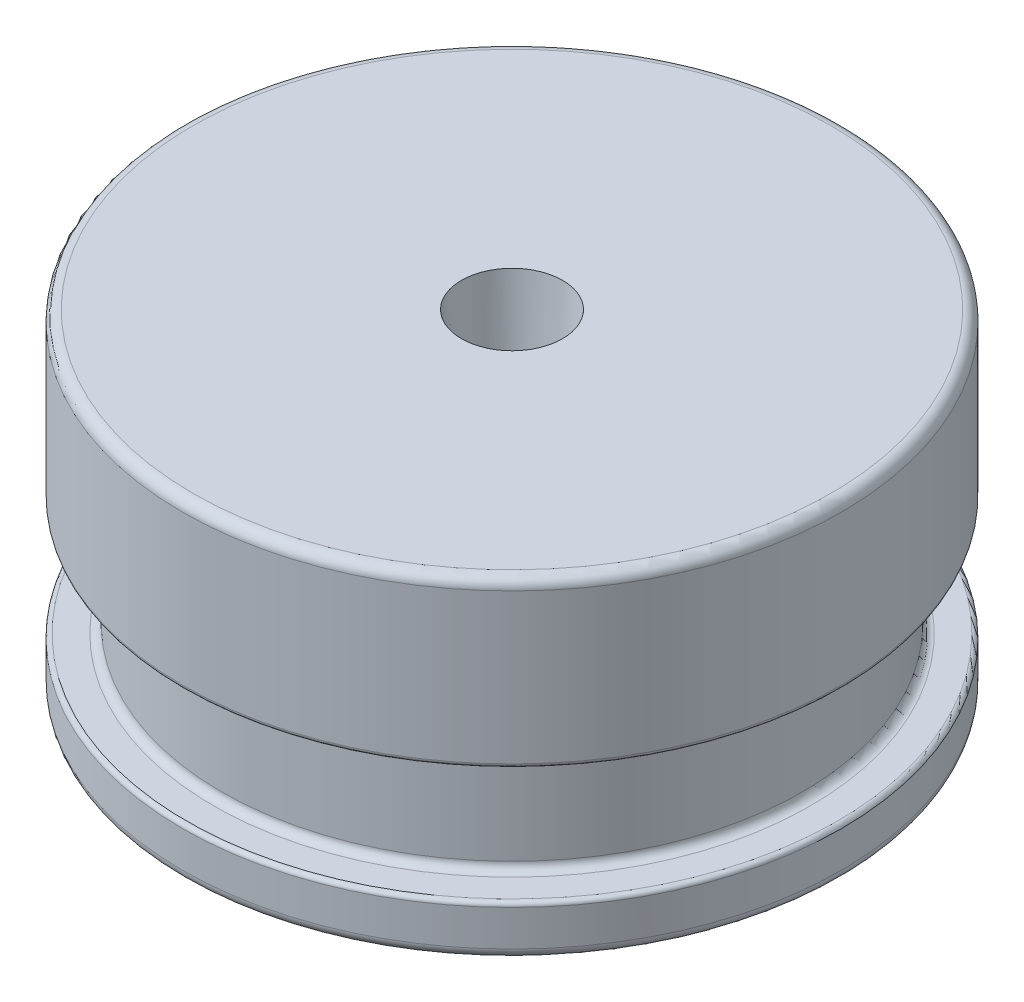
ISO-10303-21;
HEADER;
FILE_DESCRIPTION(('STEP AP214'),'2;1');
FILE_NAME('part.step','',(''),(''),'','','');
FILE_SCHEMA(('AUTOMOTIVE_DESIGN { 1 0 10303 214 1 1 1 1 }'));
ENDSEC;
DATA;
#1=APPLICATION_CONTEXT('core data for automotive mechanical design processes');
#2=APPLICATION_PROTOCOL_DEFINITION('international standard','automotive_design',2000,#1);
#3=PRODUCT_CONTEXT('',#1,'mechanical');
#4=PRODUCT('Part','Part','',(#3));
#5=PRODUCT_RELATED_PRODUCT_CATEGORY('part','',(#4));
#6=PRODUCT_DEFINITION_FORMATION('','',#4);
#7=PRODUCT_DEFINITION_CONTEXT('part definition',#1,'design');
#8=PRODUCT_DEFINITION('design','',#6,#7);
#9=PRODUCT_DEFINITION_SHAPE('','',#8);
#10=(LENGTH_UNIT() NAMED_UNIT(*) SI_UNIT(.MILLI.,.METRE.));
#11=(NAMED_UNIT(*) PLANE_ANGLE_UNIT() SI_UNIT($,.RADIAN.));
#12=(NAMED_UNIT(*) SI_UNIT($,.STERADIAN.) SOLID_ANGLE_UNIT());
#13=UNCERTAINTY_MEASURE_WITH_UNIT(LENGTH_MEASURE(1.E-05),#10,'distance_accuracy_value','');
#14=(GEOMETRIC_REPRESENTATION_CONTEXT(3) GLOBAL_UNCERTAINTY_ASSIGNED_CONTEXT((#13)) GLOBAL_UNIT_ASSIGNED_CONTEXT((#10,
#11,#12)) REPRESENTATION_CONTEXT('',''));
#15=CARTESIAN_POINT('',(0.,0.,0.));
#16=DIRECTION('',(0.,0.,1.));
#17=DIRECTION('',(1.,0.,0.));
#18=AXIS2_PLACEMENT_3D('',#15,#16,#17);
#19=CARTESIAN_POINT('',(1.7272,0.,0.));
#20=DIRECTION('',(0.,1.,0.));
#21=DIRECTION('',(0.,0.,1.));
#22=AXIS2_PLACEMENT_3D('',#19,#20,#21);
#23=PLANE('',#22);
#24=CARTESIAN_POINT('',(0.,0.,0.));
#25=DIRECTION('',(0.,1.,0.));
#26=DIRECTION('',(0.,0.,1.));
#27=AXIS2_PLACEMENT_3D('',#24,#25,#26);
#28=CIRCLE('',#27,12.9806674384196);
#29=CARTESIAN_POINT('',(0.,0.,12.9806674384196));
#30=VERTEX_POINT('',#29);
#31=EDGE_CURVE('E56',#30,#30,#28,.T.);
#32=ORIENTED_EDGE('',*,*,#31,.T.);
#33=EDGE_LOOP('',(#32));
#34=FACE_BOUND('',#33,.T.);
#35=CARTESIAN_POINT('',(0.,0.,0.));
#36=DIRECTION('',(0.,1.,0.));
#37=DIRECTION('',(0.,0.,1.));
#38=AXIS2_PLACEMENT_3D('',#35,#36,#37);
#39=CIRCLE('',#38,15.0495);
#40=CARTESIAN_POINT('',(0.,0.,15.0495));
#41=VERTEX_POINT('',#40);
#42=EDGE_CURVE('E69',#41,#41,#39,.F.);
#43=ORIENTED_EDGE('',*,*,#42,.T.);
#44=EDGE_LOOP('',(#43));
#45=FACE_BOUND('',#44,.T.);
#46=ADVANCED_FACE('F35',(#34,#45),#23,.F.);
#47=CARTESIAN_POINT('',(0.,19.7432386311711,0.));
#48=DIRECTION('',(0.,1.,0.));
#49=DIRECTION('',(0.,0.,1.));
#50=AXIS2_PLACEMENT_3D('',#47,#48,#49);
#51=CYLINDRICAL_SURFACE('',#50,1.7272);
#52=CARTESIAN_POINT('',(0.,8.10867846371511,0.));
#53=DIRECTION('',(0.,-1.,0.));
#54=DIRECTION('',(0.,0.,-1.));
#55=AXIS2_PLACEMENT_3D('',#52,#53,#54);
#56=CIRCLE('',#55,1.7272);
#57=CARTESIAN_POINT('',(0.,8.10867846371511,-1.7272));
#58=VERTEX_POINT('',#57);
#59=EDGE_CURVE('E63',#58,#58,#56,.T.);
#60=ORIENTED_EDGE('',*,*,#59,.F.);
#61=EDGE_LOOP('',(#60));
#62=FACE_BOUND('',#61,.T.);
#63=CARTESIAN_POINT('',(0.,0.,0.));
#64=DIRECTION('',(0.,1.,0.));
#65=DIRECTION('',(0.,0.,1.));
#66=AXIS2_PLACEMENT_3D('',#63,#64,#65);
#67=CIRCLE('',#66,1.7272);
#68=CARTESIAN_POINT('',(0.,0.,1.7272));
#69=VERTEX_POINT('',#68);
#70=EDGE_CURVE('E59',#69,#69,#67,.T.);
#71=ORIENTED_EDGE('',*,*,#70,.F.);
#72=EDGE_LOOP('',(#71));
#73=FACE_BOUND('',#72,.T.);
#74=ADVANCED_FACE('F105',(#62,#73),#51,.F.);
#75=CARTESIAN_POINT('',(0.,0.,0.));
#76=DIRECTION('',(0.,-1.,0.));
#77=DIRECTION('',(0.,0.,-1.));
#78=AXIS2_PLACEMENT_3D('',#75,#76,#77);
#79=CIRCLE('',#78,7.84733256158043);
#80=CARTESIAN_POINT('',(0.,0.,-7.84733256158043));
#81=VERTEX_POINT('',#80);
#82=EDGE_CURVE('E60',#81,#81,#79,.T.);
#83=ORIENTED_EDGE('',*,*,#82,.T.);
#84=EDGE_LOOP('',(#83));
#85=FACE_BOUND('',#84,.T.);
#86=ORIENTED_EDGE('',*,*,#70,.T.);
#87=EDGE_LOOP('',(#86));
#88=FACE_BOUND('',#87,.T.);
#89=ADVANCED_FACE('F37',(#85,#88),#23,.F.);
#90=CARTESIAN_POINT('',(0.,19.7432386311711,0.));
#91=DIRECTION('',(0.,1.,0.));
#92=DIRECTION('',(0.,0.,1.));
#93=AXIS2_PLACEMENT_3D('',#90,#91,#92);
#94=CYLINDRICAL_SURFACE('',#93,15.5575);
#95=CARTESIAN_POINT('',(0.,2.2098,0.));
#96=DIRECTION('',(0.,-1.,0.));
#97=DIRECTION('',(0.,0.,-1.));
#98=AXIS2_PLACEMENT_3D('',#95,#96,#97);
#99=CIRCLE('',#98,15.5575);
#100=CARTESIAN_POINT('',(0.,2.2098,-15.5575));
#101=VERTEX_POINT('',#100);
#102=EDGE_CURVE('E12',#101,#101,#99,.T.);
#103=ORIENTED_EDGE('',*,*,#102,.T.);
#104=EDGE_LOOP('',(#103));
#105=FACE_BOUND('',#104,.T.);
#106=CARTESIAN_POINT('',(0.,0.508000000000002,0.));
#107=DIRECTION('',(0.,1.,0.));
#108=DIRECTION('',(0.,0.,1.));
#109=AXIS2_PLACEMENT_3D('',#106,#107,#108);
#110=CIRCLE('',#109,15.5575);
#111=CARTESIAN_POINT('',(0.,0.508000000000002,15.5575));
#112=VERTEX_POINT('',#111);
#113=EDGE_CURVE('E72',#112,#112,#110,.T.);
#114=ORIENTED_EDGE('',*,*,#113,.T.);
#115=EDGE_LOOP('',(#114));
#116=FACE_BOUND('',#115,.T.);
#117=ADVANCED_FACE('F112',(#105,#116),#94,.T.);
#118=CARTESIAN_POINT('',(13.716,2.413,0.));
#119=DIRECTION('',(0.,-1.,0.));
#120=DIRECTION('',(0.,0.,-1.));
#121=AXIS2_PLACEMENT_3D('',#118,#119,#120);
#122=PLANE('',#121);
#123=CARTESIAN_POINT('',(0.,2.413,0.));
#124=DIRECTION('',(0.,-1.,0.));
#125=DIRECTION('',(0.,0.,-1.));
#126=AXIS2_PLACEMENT_3D('',#123,#124,#125);
#127=CIRCLE('',#126,15.3543);
#128=CARTESIAN_POINT('',(0.,2.413,-15.3543));
#129=VERTEX_POINT('',#128);
#130=EDGE_CURVE('E42',#129,#129,#127,.F.);
#131=ORIENTED_EDGE('',*,*,#130,.T.);
#132=EDGE_LOOP('',(#131));
#133=FACE_BOUND('',#132,.T.);
#134=CARTESIAN_POINT('',(0.,2.413,0.));
#135=DIRECTION('',(0.,-1.,0.));
#136=DIRECTION('',(0.,0.,-1.));
#137=AXIS2_PLACEMENT_3D('',#134,#135,#136);
#138=CIRCLE('',#137,14.097);
#139=CARTESIAN_POINT('',(0.,2.413,-14.097));
#140=VERTEX_POINT('',#139);
#141=EDGE_CURVE('E78',#140,#140,#138,.T.);
#142=ORIENTED_EDGE('',*,*,#141,.T.);
#143=EDGE_LOOP('',(#142));
#144=FACE_BOUND('',#143,.T.);
#145=ADVANCED_FACE('F117',(#133,#144),#122,.F.);
#146=CARTESIAN_POINT('',(0.,19.7432386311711,0.));
#147=DIRECTION('',(0.,1.,0.));
#148=DIRECTION('',(0.,0.,1.));
#149=AXIS2_PLACEMENT_3D('',#146,#147,#148);
#150=CYLINDRICAL_SURFACE('',#149,13.716);
#151=CARTESIAN_POINT('',(0.,2.794,0.));
#152=DIRECTION('',(0.,-1.,0.));
#153=DIRECTION('',(0.,0.,-1.));
#154=AXIS2_PLACEMENT_3D('',#151,#152,#153);
#155=CIRCLE('',#154,13.716);
#156=CARTESIAN_POINT('',(0.,2.794,-13.716));
#157=VERTEX_POINT('',#156);
#158=EDGE_CURVE('E81',#157,#157,#155,.F.);
#159=ORIENTED_EDGE('',*,*,#158,.T.);
#160=EDGE_LOOP('',(#159));
#161=FACE_BOUND('',#160,.T.);
#162=CARTESIAN_POINT('',(0.,7.493,0.));
#163=DIRECTION('',(0.,1.,0.));
#164=DIRECTION('',(0.,0.,1.));
#165=AXIS2_PLACEMENT_3D('',#162,#163,#164);
#166=CIRCLE('',#165,13.716);
#167=CARTESIAN_POINT('',(0.,7.493,13.716));
#168=VERTEX_POINT('',#167);
#169=EDGE_CURVE('E84',#168,#168,#166,.F.);
#170=ORIENTED_EDGE('',*,*,#169,.T.);
#171=EDGE_LOOP('',(#170));
#172=FACE_BOUND('',#171,.T.);
#173=ADVANCED_FACE('F158',(#161,#172),#150,.T.);
#174=CARTESIAN_POINT('',(13.716,7.874,0.));
#175=DIRECTION('',(0.,1.,0.));
#176=DIRECTION('',(0.,0.,1.));
#177=AXIS2_PLACEMENT_3D('',#174,#175,#176);
#178=PLANE('',#177);
#179=CARTESIAN_POINT('',(0.,7.874,0.));
#180=DIRECTION('',(0.,1.,0.));
#181=DIRECTION('',(0.,0.,1.));
#182=AXIS2_PLACEMENT_3D('',#179,#180,#181);
#183=CIRCLE('',#182,15.3543);
#184=CARTESIAN_POINT('',(0.,7.874,15.3543));
#185=VERTEX_POINT('',#184);
#186=EDGE_CURVE('E46',#185,#185,#183,.F.);
#187=ORIENTED_EDGE('',*,*,#186,.T.);
#188=EDGE_LOOP('',(#187));
#189=FACE_BOUND('',#188,.T.);
#190=CARTESIAN_POINT('',(0.,7.874,0.));
#191=DIRECTION('',(0.,1.,0.));
#192=DIRECTION('',(0.,0.,1.));
#193=AXIS2_PLACEMENT_3D('',#190,#191,#192);
#194=CIRCLE('',#193,14.097);
#195=CARTESIAN_POINT('',(0.,7.874,14.097));
#196=VERTEX_POINT('',#195);
#197=EDGE_CURVE('E75',#196,#196,#194,.T.);
#198=ORIENTED_EDGE('',*,*,#197,.T.);
#199=EDGE_LOOP('',(#198));
#200=FACE_BOUND('',#199,.T.);
#201=ADVANCED_FACE('F154',(#189,#200),#178,.F.);
#202=CARTESIAN_POINT('',(0.,19.7432386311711,0.));
#203=DIRECTION('',(0.,1.,0.));
#204=DIRECTION('',(0.,0.,1.));
#205=AXIS2_PLACEMENT_3D('',#202,#203,#204);
#206=CYLINDRICAL_SURFACE('',#205,15.5575);
#207=CARTESIAN_POINT('',(0.,8.0772,0.));
#208=DIRECTION('',(0.,1.,0.));
#209=DIRECTION('',(0.,0.,1.));
#210=AXIS2_PLACEMENT_3D('',#207,#208,#209);
#211=CIRCLE('',#210,15.5575);
#212=CARTESIAN_POINT('',(0.,8.0772,15.5575));
#213=VERTEX_POINT('',#212);
#214=EDGE_CURVE('E50',#213,#213,#211,.T.);
#215=ORIENTED_EDGE('',*,*,#214,.T.);
#216=EDGE_LOOP('',(#215));
#217=FACE_BOUND('',#216,.T.);
#218=CARTESIAN_POINT('',(0.,15.1490850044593,0.));
#219=DIRECTION('',(0.,1.,0.));
#220=DIRECTION('',(0.,0.,1.));
#221=AXIS2_PLACEMENT_3D('',#218,#219,#220);
#222=CIRCLE('',#221,15.5575);
#223=CARTESIAN_POINT('',(0.,15.1490850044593,15.5575));
#224=VERTEX_POINT('',#223);
#225=EDGE_CURVE('E55',#224,#224,#222,.F.);
#226=ORIENTED_EDGE('',*,*,#225,.T.);
#227=EDGE_LOOP('',(#226));
#228=FACE_BOUND('',#227,.T.);
#229=ADVANCED_FACE('F149',(#217,#228),#206,.T.);
#230=CARTESIAN_POINT('',(0.,2.794,0.));
#231=DIRECTION('',(0.,-1.,0.));
#232=DIRECTION('',(0.,0.,-1.));
#233=AXIS2_PLACEMENT_3D('',#230,#231,#232);
#234=TOROIDAL_SURFACE('',#233,14.097,0.381);
#235=ORIENTED_EDGE('',*,*,#141,.F.);
#236=EDGE_LOOP('',(#235));
#237=FACE_BOUND('',#236,.T.);
#238=ORIENTED_EDGE('',*,*,#158,.F.);
#239=EDGE_LOOP('',(#238));
#240=FACE_BOUND('',#239,.T.);
#241=ADVANCED_FACE('F146',(#237,#240),#234,.F.);
#242=CARTESIAN_POINT('',(0.,7.493,0.));
#243=DIRECTION('',(0.,1.,0.));
#244=DIRECTION('',(0.,0.,1.));
#245=AXIS2_PLACEMENT_3D('',#242,#243,#244);
#246=TOROIDAL_SURFACE('',#245,14.097,0.381);
#247=ORIENTED_EDGE('',*,*,#169,.F.);
#248=EDGE_LOOP('',(#247));
#249=FACE_BOUND('',#248,.T.);
#250=ORIENTED_EDGE('',*,*,#197,.F.);
#251=EDGE_LOOP('',(#250));
#252=FACE_BOUND('',#251,.T.);
#253=ADVANCED_FACE('F140',(#249,#252),#246,.F.);
#254=CARTESIAN_POINT('',(0.,15.6570850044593,0.));
#255=DIRECTION('',(0.,1.,0.));
#256=DIRECTION('',(0.,0.,1.));
#257=AXIS2_PLACEMENT_3D('',#254,#255,#256);
#258=PLANE('',#257);
#259=CARTESIAN_POINT('',(0.,15.6570850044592,0.));
#260=DIRECTION('',(0.,-1.,0.));
#261=DIRECTION('',(0.,0.,-1.));
#262=AXIS2_PLACEMENT_3D('',#259,#260,#261);
#263=CIRCLE('',#262,2.3876);
#264=CARTESIAN_POINT('',(0.,15.6570850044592,-2.3876));
#265=VERTEX_POINT('',#264);
#266=EDGE_CURVE('E91',#265,#265,#263,.T.);
#267=ORIENTED_EDGE('',*,*,#266,.T.);
#268=EDGE_LOOP('',(#267));
#269=FACE_BOUND('',#268,.T.);
#270=CARTESIAN_POINT('',(0.,15.6570850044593,0.));
#271=DIRECTION('',(0.,1.,0.));
#272=DIRECTION('',(0.,0.,1.));
#273=AXIS2_PLACEMENT_3D('',#270,#271,#272);
#274=CIRCLE('',#273,15.0495);
#275=CARTESIAN_POINT('',(0.,15.6570850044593,15.0495));
#276=VERTEX_POINT('',#275);
#277=EDGE_CURVE('E66',#276,#276,#274,.T.);
#278=ORIENTED_EDGE('',*,*,#277,.T.);
#279=EDGE_LOOP('',(#278));
#280=FACE_BOUND('',#279,.T.);
#281=ADVANCED_FACE('F95',(#269,#280),#258,.T.);
#282=CARTESIAN_POINT('',(0.,0.508000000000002,0.));
#283=DIRECTION('',(0.,1.,0.));
#284=DIRECTION('',(0.,0.,1.));
#285=AXIS2_PLACEMENT_3D('',#282,#283,#284);
#286=TOROIDAL_SURFACE('',#285,15.0495,0.508);
#287=ORIENTED_EDGE('',*,*,#42,.F.);
#288=EDGE_LOOP('',(#287));
#289=FACE_BOUND('',#288,.T.);
#290=ORIENTED_EDGE('',*,*,#113,.F.);
#291=EDGE_LOOP('',(#290));
#292=FACE_BOUND('',#291,.T.);
#293=ADVANCED_FACE('F126',(#289,#292),#286,.T.);
#294=CARTESIAN_POINT('',(0.,15.1490850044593,0.));
#295=DIRECTION('',(0.,1.,0.));
#296=DIRECTION('',(0.,0.,1.));
#297=AXIS2_PLACEMENT_3D('',#294,#295,#296);
#298=TOROIDAL_SURFACE('',#297,15.0495,0.508);
#299=ORIENTED_EDGE('',*,*,#225,.F.);
#300=EDGE_LOOP('',(#299));
#301=FACE_BOUND('',#300,.T.);
#302=ORIENTED_EDGE('',*,*,#277,.F.);
#303=EDGE_LOOP('',(#302));
#304=FACE_BOUND('',#303,.T.);
#305=ADVANCED_FACE('F129',(#301,#304),#298,.T.);
#306=CARTESIAN_POINT('',(0.,-1.86891499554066,0.));
#307=DIRECTION('',(0.,-1.,0.));
#308=DIRECTION('',(0.,0.,-1.));
#309=AXIS2_PLACEMENT_3D('',#306,#307,#308);
#310=TOROIDAL_SURFACE('',#309,10.414,3.175);
#311=ORIENTED_EDGE('',*,*,#82,.F.);
#312=EDGE_LOOP('',(#311));
#313=FACE_BOUND('',#312,.T.);
#314=ORIENTED_EDGE('',*,*,#31,.F.);
#315=EDGE_LOOP('',(#314));
#316=FACE_BOUND('',#315,.T.);
#317=ADVANCED_FACE('F137',(#313,#316),#310,.F.);
#318=CARTESIAN_POINT('',(0.,8.0772,0.));
#319=DIRECTION('',(0.,1.,0.));
#320=DIRECTION('',(0.,0.,1.));
#321=AXIS2_PLACEMENT_3D('',#318,#319,#320);
#322=TOROIDAL_SURFACE('',#321,15.3543,0.2032);
#323=ORIENTED_EDGE('',*,*,#186,.F.);
#324=EDGE_LOOP('',(#323));
#325=FACE_BOUND('',#324,.T.);
#326=ORIENTED_EDGE('',*,*,#214,.F.);
#327=EDGE_LOOP('',(#326));
#328=FACE_BOUND('',#327,.T.);
#329=ADVANCED_FACE('F221',(#325,#328),#322,.T.);
#330=CARTESIAN_POINT('',(0.,2.2098,0.));
#331=DIRECTION('',(0.,-1.,0.));
#332=DIRECTION('',(0.,0.,-1.));
#333=AXIS2_PLACEMENT_3D('',#330,#331,#332);
#334=TOROIDAL_SURFACE('',#333,15.3543,0.2032);
#335=ORIENTED_EDGE('',*,*,#102,.F.);
#336=EDGE_LOOP('',(#335));
#337=FACE_BOUND('',#336,.T.);
#338=ORIENTED_EDGE('',*,*,#130,.F.);
#339=EDGE_LOOP('',(#338));
#340=FACE_BOUND('',#339,.T.);
#341=ADVANCED_FACE('F101',(#337,#340),#334,.T.);
#342=CARTESIAN_POINT('',(0.,8.10867846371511,0.));
#343=DIRECTION('',(0.,1.,0.));
#344=DIRECTION('',(0.,0.,1.));
#345=AXIS2_PLACEMENT_3D('',#342,#343,#344);
#346=CONICAL_SURFACE('',#345,1.7272,0.0872664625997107);
#347=ORIENTED_EDGE('',*,*,#266,.F.);
#348=EDGE_LOOP('',(#347));
#349=FACE_BOUND('',#348,.T.);
#350=ORIENTED_EDGE('',*,*,#59,.T.);
#351=EDGE_LOOP('',(#350));
#352=FACE_BOUND('',#351,.T.);
#353=ADVANCED_FACE('F98',(#349,#352),#346,.F.);
#354=CLOSED_SHELL('',(#46,#74,#89,#117,#145,#173,#201,#229,#241,#253,#281,#293,#305,#317,#329,
#341,#353));
#355=MANIFOLD_SOLID_BREP('B2',#354);
#356=ADVANCED_BREP_SHAPE_REPRESENTATION('',(#18,#355),#14);
#357=SHAPE_DEFINITION_REPRESENTATION(#9,#356);
ENDSEC;
END-ISO-10303-21;
